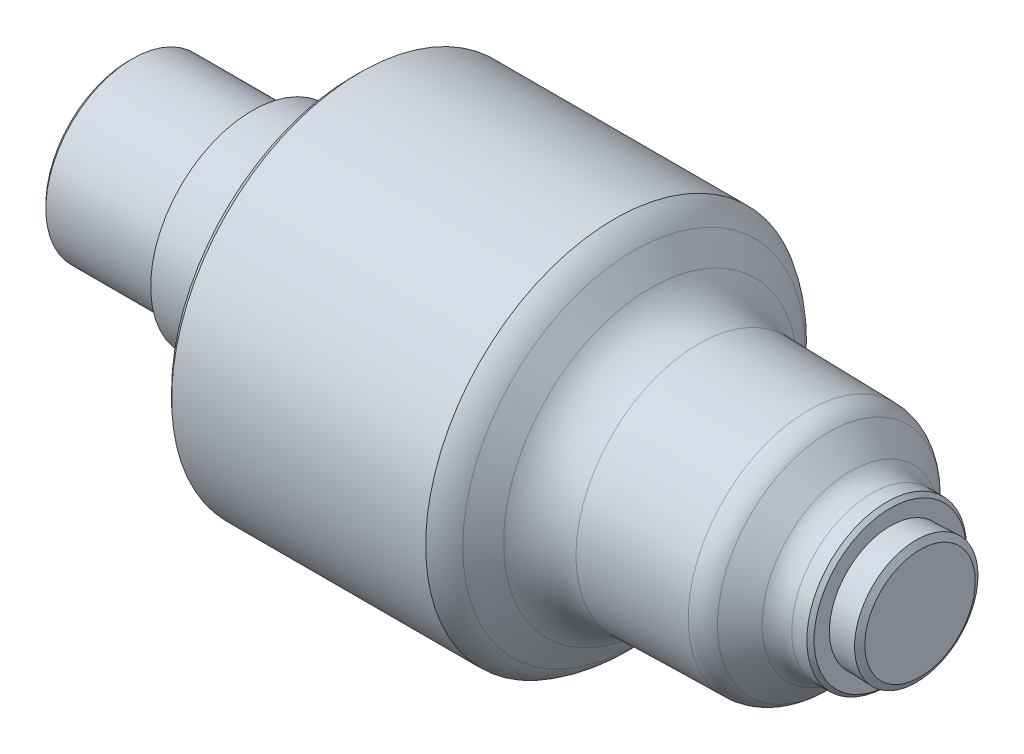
ISO-10303-21;
HEADER;
FILE_DESCRIPTION(('STEP AP214'),'2;1');
FILE_NAME('part.step','',(''),(''),'','','');
FILE_SCHEMA(('AUTOMOTIVE_DESIGN { 1 0 10303 214 1 1 1 1 }'));
ENDSEC;
DATA;
#1=APPLICATION_CONTEXT('core data for automotive mechanical design processes');
#2=APPLICATION_PROTOCOL_DEFINITION('international standard','automotive_design',2000,#1);
#3=PRODUCT_CONTEXT('',#1,'mechanical');
#4=PRODUCT('Part','Part','',(#3));
#5=PRODUCT_RELATED_PRODUCT_CATEGORY('part','',(#4));
#6=PRODUCT_DEFINITION_FORMATION('','',#4);
#7=PRODUCT_DEFINITION_CONTEXT('part definition',#1,'design');
#8=PRODUCT_DEFINITION('design','',#6,#7);
#9=PRODUCT_DEFINITION_SHAPE('','',#8);
#10=(LENGTH_UNIT() NAMED_UNIT(*) SI_UNIT(.MILLI.,.METRE.));
#11=(NAMED_UNIT(*) PLANE_ANGLE_UNIT() SI_UNIT($,.RADIAN.));
#12=(NAMED_UNIT(*) SI_UNIT($,.STERADIAN.) SOLID_ANGLE_UNIT());
#13=UNCERTAINTY_MEASURE_WITH_UNIT(LENGTH_MEASURE(1.E-05),#10,'distance_accuracy_value','');
#14=(GEOMETRIC_REPRESENTATION_CONTEXT(3) GLOBAL_UNCERTAINTY_ASSIGNED_CONTEXT((#13)) GLOBAL_UNIT_ASSIGNED_CONTEXT((#10,
#11,#12)) REPRESENTATION_CONTEXT('',''));
#15=CARTESIAN_POINT('',(0.,0.,0.));
#16=DIRECTION('',(0.,0.,1.));
#17=DIRECTION('',(1.,0.,0.));
#18=AXIS2_PLACEMENT_3D('',#15,#16,#17);
#19=CARTESIAN_POINT('',(14.4277845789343,12.4765331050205,0.));
#20=DIRECTION('',(-1.,0.,0.));
#21=DIRECTION('',(0.,0.,1.));
#22=AXIS2_PLACEMENT_3D('',#19,#20,#21);
#23=CONICAL_SURFACE('',#22,0.47545206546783,1.04719587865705);
#24=CARTESIAN_POINT('',(14.3954459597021,12.4765331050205,0.));
#25=DIRECTION('',(1.,0.,0.));
#26=DIRECTION('',(0.,0.,-1.));
#27=AXIS2_PLACEMENT_3D('',#24,#25,#26);
#28=CIRCLE('',#27,0.53146398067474);
#29=CARTESIAN_POINT('',(14.3954459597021,12.4765331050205,-0.53146398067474));
#30=VERTEX_POINT('',#29);
#31=EDGE_CURVE('E45',#30,#30,#28,.T.);
#32=ORIENTED_EDGE('',*,*,#31,.T.);
#33=EDGE_LOOP('',(#32));
#34=FACE_BOUND('',#33,.T.);
#35=CARTESIAN_POINT('',(14.4277845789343,12.4765331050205,0.));
#36=DIRECTION('',(1.,0.,0.));
#37=DIRECTION('',(0.,0.,-1.));
#38=AXIS2_PLACEMENT_3D('',#35,#36,#37);
#39=CIRCLE('',#38,0.47545206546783);
#40=CARTESIAN_POINT('',(14.4277845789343,12.4765331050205,-0.47545206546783));
#41=VERTEX_POINT('',#40);
#42=EDGE_CURVE('E111',#41,#41,#39,.T.);
#43=ORIENTED_EDGE('',*,*,#42,.F.);
#44=EDGE_LOOP('',(#43));
#45=FACE_BOUND('',#44,.T.);
#46=ADVANCED_FACE('F32',(#34,#45),#23,.T.);
#47=CARTESIAN_POINT('',(14.1717845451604,12.4765331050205,0.));
#48=DIRECTION('',(1.,0.,0.));
#49=DIRECTION('',(0.,0.,-1.));
#50=AXIS2_PLACEMENT_3D('',#47,#48,#49);
#51=CONICAL_SURFACE('',#50,0.524630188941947,0.0305446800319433);
#52=ORIENTED_EDGE('',*,*,#31,.F.);
#53=EDGE_LOOP('',(#52));
#54=FACE_BOUND('',#53,.T.);
#55=CARTESIAN_POINT('',(14.1717845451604,12.4765331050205,0.));
#56=DIRECTION('',(1.,0.,0.));
#57=DIRECTION('',(0.,0.,-1.));
#58=AXIS2_PLACEMENT_3D('',#55,#56,#57);
#59=CIRCLE('',#58,0.524630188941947);
#60=CARTESIAN_POINT('',(14.1717845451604,12.4765331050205,-0.524630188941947));
#61=VERTEX_POINT('',#60);
#62=EDGE_CURVE('E49',#61,#61,#59,.T.);
#63=ORIENTED_EDGE('',*,*,#62,.T.);
#64=EDGE_LOOP('',(#63));
#65=FACE_BOUND('',#64,.T.);
#66=ADVANCED_FACE('F123',(#54,#65),#51,.T.);
#67=CARTESIAN_POINT('',(14.1717845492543,-8.30016112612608,0.));
#68=DIRECTION('',(-1.,0.,0.));
#69=DIRECTION('',(0.,0.,1.));
#70=AXIS2_PLACEMENT_3D('',#67,#68,#69);
#71=PLANE('',#70);
#72=ORIENTED_EDGE('',*,*,#62,.F.);
#73=EDGE_LOOP('',(#72));
#74=FACE_BOUND('',#73,.T.);
#75=CARTESIAN_POINT('',(14.1717845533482,12.4765331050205,0.));
#76=DIRECTION('',(1.,0.,0.));
#77=DIRECTION('',(0.,0.,-1.));
#78=AXIS2_PLACEMENT_3D('',#75,#76,#77);
#79=CIRCLE('',#78,0.656500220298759);
#80=CARTESIAN_POINT('',(14.1717845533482,12.4765331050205,-0.656500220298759));
#81=VERTEX_POINT('',#80);
#82=EDGE_CURVE('E54',#81,#81,#79,.T.);
#83=ORIENTED_EDGE('',*,*,#82,.T.);
#84=EDGE_LOOP('',(#83));
#85=FACE_BOUND('',#84,.T.);
#86=ADVANCED_FACE('F127',(#74,#85),#71,.F.);
#87=CARTESIAN_POINT('',(14.1407866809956,12.4765331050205,0.));
#88=DIRECTION('',(-1.,0.,0.));
#89=DIRECTION('',(0.,0.,1.));
#90=AXIS2_PLACEMENT_3D('',#87,#88,#89);
#91=CONICAL_SURFACE('',#90,0.687498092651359,0.785398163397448);
#92=ORIENTED_EDGE('',*,*,#82,.F.);
#93=EDGE_LOOP('',(#92));
#94=FACE_BOUND('',#93,.T.);
#95=CARTESIAN_POINT('',(14.1407866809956,12.4765331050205,0.));
#96=DIRECTION('',(1.,0.,0.));
#97=DIRECTION('',(0.,0.,-1.));
#98=AXIS2_PLACEMENT_3D('',#95,#96,#97);
#99=CIRCLE('',#98,0.687498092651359);
#100=CARTESIAN_POINT('',(14.1407866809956,12.4765331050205,-0.687498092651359));
#101=VERTEX_POINT('',#100);
#102=EDGE_CURVE('E57',#101,#101,#99,.T.);
#103=ORIENTED_EDGE('',*,*,#102,.T.);
#104=EDGE_LOOP('',(#103));
#105=FACE_BOUND('',#104,.T.);
#106=ADVANCED_FACE('F131',(#94,#105),#91,.T.);
#107=CARTESIAN_POINT('',(14.4877113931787,12.4765331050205,0.));
#108=DIRECTION('',(1.,0.,0.));
#109=DIRECTION('',(0.,0.,-1.));
#110=AXIS2_PLACEMENT_3D('',#107,#108,#109);
#111=CYLINDRICAL_SURFACE('',#110,0.687498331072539);
#112=ORIENTED_EDGE('',*,*,#102,.F.);
#113=EDGE_LOOP('',(#112));
#114=FACE_BOUND('',#113,.T.);
#115=CARTESIAN_POINT('',(14.0113916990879,12.4765331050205,0.));
#116=DIRECTION('',(1.,0.,0.));
#117=DIRECTION('',(0.,0.,-1.));
#118=AXIS2_PLACEMENT_3D('',#115,#116,#117);
#119=CIRCLE('',#118,0.687498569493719);
#120=CARTESIAN_POINT('',(14.0113916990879,12.4765331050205,-0.687498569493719));
#121=VERTEX_POINT('',#120);
#122=EDGE_CURVE('E60',#121,#121,#119,.T.);
#123=ORIENTED_EDGE('',*,*,#122,.T.);
#124=EDGE_LOOP('',(#123));
#125=FACE_BOUND('',#124,.T.);
#126=ADVANCED_FACE('F135',(#114,#125),#111,.T.);
#127=CARTESIAN_POINT('',(14.0113926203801,12.4765331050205,0.));
#128=DIRECTION('',(1.,0.,0.));
#129=DIRECTION('',(0.,0.,-1.));
#130=AXIS2_PLACEMENT_3D('',#127,#128,#129);
#131=TOROIDAL_SURFACE('',#130,0.937498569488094,0.249999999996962);
#132=ORIENTED_EDGE('',*,*,#122,.F.);
#133=EDGE_LOOP('',(#132));
#134=FACE_BOUND('',#133,.T.);
#135=CARTESIAN_POINT('',(13.8315569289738,12.4765331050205,0.));
#136=DIRECTION('',(1.,0.,0.));
#137=DIRECTION('',(0.,0.,-1.));
#138=AXIS2_PLACEMENT_3D('',#135,#136,#137);
#139=CIRCLE('',#138,0.763834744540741);
#140=CARTESIAN_POINT('',(13.8315569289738,12.4765331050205,-0.763834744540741));
#141=VERTEX_POINT('',#140);
#142=EDGE_CURVE('E63',#141,#141,#139,.T.);
#143=ORIENTED_EDGE('',*,*,#142,.T.);
#144=EDGE_LOOP('',(#143));
#145=FACE_BOUND('',#144,.T.);
#146=ADVANCED_FACE('F139',(#134,#145),#131,.F.);
#147=CARTESIAN_POINT('',(13.6427108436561,12.4765331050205,0.));
#148=DIRECTION('',(-1.,0.,0.));
#149=DIRECTION('',(0.,0.,1.));
#150=AXIS2_PLACEMENT_3D('',#147,#148,#149);
#151=CONICAL_SURFACE('',#150,0.959392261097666,0.802855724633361);
#152=ORIENTED_EDGE('',*,*,#142,.F.);
#153=EDGE_LOOP('',(#152));
#154=FACE_BOUND('',#153,.T.);
#155=CARTESIAN_POINT('',(13.6427108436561,12.4765331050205,0.));
#156=DIRECTION('',(1.,0.,0.));
#157=DIRECTION('',(0.,0.,-1.));
#158=AXIS2_PLACEMENT_3D('',#155,#156,#157);
#159=CIRCLE('',#158,0.959392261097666);
#160=CARTESIAN_POINT('',(13.6427108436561,12.4765331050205,-0.959392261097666));
#161=VERTEX_POINT('',#160);
#162=EDGE_CURVE('E66',#161,#161,#159,.T.);
#163=ORIENTED_EDGE('',*,*,#162,.T.);
#164=EDGE_LOOP('',(#163));
#165=FACE_BOUND('',#164,.T.);
#166=ADVANCED_FACE('F143',(#154,#165),#151,.T.);
#167=CARTESIAN_POINT('',(13.4628751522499,12.4765331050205,0.));
#168=DIRECTION('',(1.,0.,0.));
#169=DIRECTION('',(0.,0.,-1.));
#170=AXIS2_PLACEMENT_3D('',#167,#168,#169);
#171=TOROIDAL_SURFACE('',#170,0.785728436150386,0.249999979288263);
#172=CARTESIAN_POINT('',(13.4677770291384,12.4765331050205,0.));
#173=DIRECTION('',(1.,0.,0.));
#174=DIRECTION('',(0.,0.,-1.));
#175=AXIS2_PLACEMENT_3D('',#172,#173,#174);
#176=CIRCLE('',#175,1.03568033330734);
#177=CARTESIAN_POINT('',(13.4677770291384,12.4765331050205,-1.03568033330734));
#178=VERTEX_POINT('',#177);
#179=EDGE_CURVE('E69',#178,#178,#176,.T.);
#180=ORIENTED_EDGE('',*,*,#179,.T.);
#181=EDGE_LOOP('',(#180));
#182=FACE_BOUND('',#181,.T.);
#183=ORIENTED_EDGE('',*,*,#162,.F.);
#184=EDGE_LOOP('',(#183));
#185=FACE_BOUND('',#184,.T.);
#186=ADVANCED_FACE('F147',(#182,#185),#171,.T.);
#187=CARTESIAN_POINT('',(12.5190360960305,12.4765331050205,0.));
#188=DIRECTION('',(-1.,0.,0.));
#189=DIRECTION('',(0.,0.,1.));
#190=AXIS2_PLACEMENT_3D('',#187,#188,#189);
#191=CONICAL_SURFACE('',#190,1.05428635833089,0.0196087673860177);
#192=ORIENTED_EDGE('',*,*,#179,.F.);
#193=EDGE_LOOP('',(#192));
#194=FACE_BOUND('',#193,.T.);
#195=CARTESIAN_POINT('',(12.5190360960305,12.4765331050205,0.));
#196=DIRECTION('',(1.,0.,0.));
#197=DIRECTION('',(0.,0.,-1.));
#198=AXIS2_PLACEMENT_3D('',#195,#196,#197);
#199=CIRCLE('',#198,1.05428635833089);
#200=CARTESIAN_POINT('',(12.5190360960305,12.4765331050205,-1.05428635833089));
#201=VERTEX_POINT('',#200);
#202=EDGE_CURVE('E72',#201,#201,#199,.T.);
#203=ORIENTED_EDGE('',*,*,#202,.T.);
#204=EDGE_LOOP('',(#203));
#205=FACE_BOUND('',#204,.T.);
#206=ADVANCED_FACE('F151',(#194,#205),#191,.T.);
#207=CARTESIAN_POINT('',(12.5190360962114,12.4765331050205,0.));
#208=DIRECTION('',(1.,0.,0.));
#209=DIRECTION('',(0.,0.,-1.));
#210=AXIS2_PLACEMENT_3D('',#207,#208,#209);
#211=TOROIDAL_SURFACE('',#210,1.55428635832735,0.499999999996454);
#212=ORIENTED_EDGE('',*,*,#202,.F.);
#213=EDGE_LOOP('',(#212));
#214=FACE_BOUND('',#213,.T.);
#215=CARTESIAN_POINT('',(12.1094606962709,12.4765331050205,0.));
#216=DIRECTION('',(1.,0.,0.));
#217=DIRECTION('',(0.,0.,-1.));
#218=AXIS2_PLACEMENT_3D('',#215,#216,#217);
#219=CIRCLE('',#218,1.26749725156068);
#220=CARTESIAN_POINT('',(12.1094606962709,12.4765331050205,-1.26749725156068));
#221=VERTEX_POINT('',#220);
#222=EDGE_CURVE('E75',#221,#221,#219,.T.);
#223=ORIENTED_EDGE('',*,*,#222,.T.);
#224=EDGE_LOOP('',(#223));
#225=FACE_BOUND('',#224,.T.);
#226=ADVANCED_FACE('F155',(#214,#225),#211,.F.);
#227=CARTESIAN_POINT('',(11.9646636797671,12.4765331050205,0.));
#228=DIRECTION('',(-1.,0.,0.));
#229=DIRECTION('',(0.,0.,1.));
#230=AXIS2_PLACEMENT_3D('',#227,#228,#229);
#231=CONICAL_SURFACE('',#230,1.47428786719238,0.959928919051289);
#232=ORIENTED_EDGE('',*,*,#222,.F.);
#233=EDGE_LOOP('',(#232));
#234=FACE_BOUND('',#233,.T.);
#235=CARTESIAN_POINT('',(11.9646636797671,12.4765331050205,0.));
#236=DIRECTION('',(1.,0.,0.));
#237=DIRECTION('',(0.,0.,-1.));
#238=AXIS2_PLACEMENT_3D('',#235,#236,#237);
#239=CIRCLE('',#238,1.47428786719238);
#240=CARTESIAN_POINT('',(11.9646636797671,12.4765331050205,-1.47428786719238));
#241=VERTEX_POINT('',#240);
#242=EDGE_CURVE('E78',#241,#241,#239,.T.);
#243=ORIENTED_EDGE('',*,*,#242,.T.);
#244=EDGE_LOOP('',(#243));
#245=FACE_BOUND('',#244,.T.);
#246=ADVANCED_FACE('F159',(#234,#245),#231,.T.);
#247=CARTESIAN_POINT('',(11.5550882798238,12.4765331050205,0.));
#248=DIRECTION('',(1.,0.,0.));
#249=DIRECTION('',(0.,0.,-1.));
#250=AXIS2_PLACEMENT_3D('',#247,#248,#249);
#251=TOROIDAL_SURFACE('',#250,1.18749876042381,0.499999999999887);
#252=CARTESIAN_POINT('',(11.7962433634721,12.4765331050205,0.));
#253=DIRECTION('',(1.,0.,0.));
#254=DIRECTION('',(0.,0.,-1.));
#255=AXIS2_PLACEMENT_3D('',#252,#253,#254);
#256=CIRCLE('',#255,1.62549901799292);
#257=CARTESIAN_POINT('',(11.7962433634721,12.4765331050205,-1.62549901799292));
#258=VERTEX_POINT('',#257);
#259=EDGE_CURVE('E81',#258,#258,#256,.T.);
#260=ORIENTED_EDGE('',*,*,#259,.T.);
#261=EDGE_LOOP('',(#260));
#262=FACE_BOUND('',#261,.T.);
#263=ORIENTED_EDGE('',*,*,#242,.F.);
#264=EDGE_LOOP('',(#263));
#265=FACE_BOUND('',#264,.T.);
#266=ADVANCED_FACE('F163',(#262,#265),#251,.T.);
#267=CARTESIAN_POINT('',(14.4877113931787,12.4765331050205,0.));
#268=DIRECTION('',(1.,0.,0.));
#269=DIRECTION('',(0.,0.,-1.));
#270=AXIS2_PLACEMENT_3D('',#267,#268,#269);
#271=CYLINDRICAL_SURFACE('',#270,1.62549925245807);
#272=ORIENTED_EDGE('',*,*,#259,.F.);
#273=EDGE_LOOP('',(#272));
#274=FACE_BOUND('',#273,.T.);
#275=CARTESIAN_POINT('',(9.6087846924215,12.4765331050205,0.));
#276=DIRECTION('',(1.,0.,0.));
#277=DIRECTION('',(0.,0.,-1.));
#278=AXIS2_PLACEMENT_3D('',#275,#276,#277);
#279=CIRCLE('',#278,1.62549948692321);
#280=CARTESIAN_POINT('',(9.6087846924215,12.4765331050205,-1.62549948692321));
#281=VERTEX_POINT('',#280);
#282=EDGE_CURVE('E84',#281,#281,#279,.T.);
#283=ORIENTED_EDGE('',*,*,#282,.T.);
#284=EDGE_LOOP('',(#283));
#285=FACE_BOUND('',#284,.T.);
#286=ADVANCED_FACE('F167',(#274,#285),#271,.T.);
#287=CARTESIAN_POINT('',(9.6087846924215,12.4765331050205,0.));
#288=DIRECTION('',(1.,0.,0.));
#289=DIRECTION('',(0.,0.,-1.));
#290=AXIS2_PLACEMENT_3D('',#287,#288,#289);
#291=CONICAL_SURFACE('',#290,1.62549948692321,0.785398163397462);
#292=CARTESIAN_POINT('',(9.54678489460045,12.4765331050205,0.));
#293=DIRECTION('',(1.,0.,0.));
#294=DIRECTION('',(0.,0.,-1.));
#295=AXIS2_PLACEMENT_3D('',#292,#293,#294);
#296=CIRCLE('',#295,1.56349968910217);
#297=CARTESIAN_POINT('',(9.54678489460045,12.4765331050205,-1.56349968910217));
#298=VERTEX_POINT('',#297);
#299=EDGE_CURVE('E87',#298,#298,#296,.T.);
#300=ORIENTED_EDGE('',*,*,#299,.T.);
#301=EDGE_LOOP('',(#300));
#302=FACE_BOUND('',#301,.T.);
#303=ORIENTED_EDGE('',*,*,#282,.F.);
#304=EDGE_LOOP('',(#303));
#305=FACE_BOUND('',#304,.T.);
#306=ADVANCED_FACE('F171',(#302,#305),#291,.T.);
#307=CARTESIAN_POINT('',(9.5467848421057,-8.300160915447,0.));
#308=DIRECTION('',(1.,0.,0.));
#309=DIRECTION('',(0.,0.,-1.));
#310=AXIS2_PLACEMENT_3D('',#307,#308,#309);
#311=PLANE('',#310);
#312=ORIENTED_EDGE('',*,*,#299,.F.);
#313=EDGE_LOOP('',(#312));
#314=FACE_BOUND('',#313,.T.);
#315=CARTESIAN_POINT('',(9.54678478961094,12.4765331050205,0.));
#316=DIRECTION('',(1.,0.,0.));
#317=DIRECTION('',(0.,0.,-1.));
#318=AXIS2_PLACEMENT_3D('',#315,#316,#317);
#319=CIRCLE('',#318,0.875000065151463);
#320=CARTESIAN_POINT('',(9.54678478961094,12.4765331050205,-0.875000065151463));
#321=VERTEX_POINT('',#320);
#322=EDGE_CURVE('E90',#321,#321,#319,.T.);
#323=ORIENTED_EDGE('',*,*,#322,.T.);
#324=EDGE_LOOP('',(#323));
#325=FACE_BOUND('',#324,.T.);
#326=ADVANCED_FACE('F175',(#314,#325),#311,.F.);
#327=CARTESIAN_POINT('',(14.4877113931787,12.4765331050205,0.));
#328=DIRECTION('',(1.,0.,0.));
#329=DIRECTION('',(0.,0.,-1.));
#330=AXIS2_PLACEMENT_3D('',#327,#328,#329);
#331=CYLINDRICAL_SURFACE('',#330,0.875000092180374);
#332=ORIENTED_EDGE('',*,*,#322,.F.);
#333=EDGE_LOOP('',(#332));
#334=FACE_BOUND('',#333,.T.);
#335=CARTESIAN_POINT('',(8.67828430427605,12.4765331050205,0.));
#336=DIRECTION('',(1.,0.,0.));
#337=DIRECTION('',(0.,0.,-1.));
#338=AXIS2_PLACEMENT_3D('',#335,#336,#337);
#339=CIRCLE('',#338,0.875000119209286);
#340=CARTESIAN_POINT('',(8.67828430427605,12.4765331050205,-0.875000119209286));
#341=VERTEX_POINT('',#340);
#342=EDGE_CURVE('E93',#341,#341,#339,.T.);
#343=ORIENTED_EDGE('',*,*,#342,.T.);
#344=EDGE_LOOP('',(#343));
#345=FACE_BOUND('',#344,.T.);
#346=ADVANCED_FACE('F179',(#334,#345),#331,.T.);
#347=CARTESIAN_POINT('',(8.67828430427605,-8.30016112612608,0.));
#348=DIRECTION('',(-1.,0.,0.));
#349=DIRECTION('',(0.,0.,1.));
#350=AXIS2_PLACEMENT_3D('',#347,#348,#349);
#351=PLANE('',#350);
#352=CARTESIAN_POINT('',(8.67828430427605,12.4765331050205,0.));
#353=DIRECTION('',(1.,0.,0.));
#354=DIRECTION('',(0.,0.,-1.));
#355=AXIS2_PLACEMENT_3D('',#352,#353,#354);
#356=CIRCLE('',#355,0.687500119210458);
#357=CARTESIAN_POINT('',(8.67828430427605,12.4765331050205,-0.687500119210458));
#358=VERTEX_POINT('',#357);
#359=EDGE_CURVE('E96',#358,#358,#356,.T.);
#360=ORIENTED_EDGE('',*,*,#359,.T.);
#361=EDGE_LOOP('',(#360));
#362=FACE_BOUND('',#361,.T.);
#363=ORIENTED_EDGE('',*,*,#342,.F.);
#364=EDGE_LOOP('',(#363));
#365=FACE_BOUND('',#364,.T.);
#366=ADVANCED_FACE('F183',(#362,#365),#351,.T.);
#367=CARTESIAN_POINT('',(8.67828430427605,12.4765331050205,0.));
#368=DIRECTION('',(1.,0.,0.));
#369=DIRECTION('',(0.,0.,-1.));
#370=AXIS2_PLACEMENT_3D('',#367,#368,#369);
#371=TOROIDAL_SURFACE('',#370,0.750000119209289,0.062499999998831);
#372=ORIENTED_EDGE('',*,*,#359,.F.);
#373=EDGE_LOOP('',(#372));
#374=FACE_BOUND('',#373,.T.);
#375=CARTESIAN_POINT('',(8.63409044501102,12.4765331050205,0.));
#376=DIRECTION('',(1.,0.,0.));
#377=DIRECTION('',(0.,0.,-1.));
#378=AXIS2_PLACEMENT_3D('',#375,#376,#377);
#379=CIRCLE('',#378,0.705805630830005);
#380=CARTESIAN_POINT('',(8.63409044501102,12.4765331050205,-0.705805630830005));
#381=VERTEX_POINT('',#380);
#382=EDGE_CURVE('E99',#381,#381,#379,.T.);
#383=ORIENTED_EDGE('',*,*,#382,.T.);
#384=EDGE_LOOP('',(#383));
#385=FACE_BOUND('',#384,.T.);
#386=ADVANCED_FACE('F187',(#374,#385),#371,.F.);
#387=CARTESIAN_POINT('',(8.63409044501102,12.4765331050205,0.));
#388=DIRECTION('',(-1.,0.,0.));
#389=DIRECTION('',(0.,0.,1.));
#390=AXIS2_PLACEMENT_3D('',#387,#388,#389);
#391=CONICAL_SURFACE('',#390,0.705805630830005,0.785391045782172);
#392=CARTESIAN_POINT('',(8.59389509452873,12.4765331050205,0.));
#393=DIRECTION('',(1.,0.,0.));
#394=DIRECTION('',(0.,0.,-1.));
#395=AXIS2_PLACEMENT_3D('',#392,#393,#394);
#396=CIRCLE('',#395,0.746000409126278);
#397=CARTESIAN_POINT('',(8.59389509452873,12.4765331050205,-0.746000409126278));
#398=VERTEX_POINT('',#397);
#399=EDGE_CURVE('E102',#398,#398,#396,.T.);
#400=ORIENTED_EDGE('',*,*,#399,.T.);
#401=EDGE_LOOP('',(#400));
#402=FACE_BOUND('',#401,.T.);
#403=ORIENTED_EDGE('',*,*,#382,.F.);
#404=EDGE_LOOP('',(#403));
#405=FACE_BOUND('',#404,.T.);
#406=ADVANCED_FACE('F191',(#402,#405),#391,.T.);
#407=CARTESIAN_POINT('',(14.4877113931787,12.4765331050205,0.));
#408=DIRECTION('',(1.,0.,0.));
#409=DIRECTION('',(0.,0.,-1.));
#410=AXIS2_PLACEMENT_3D('',#407,#408,#409);
#411=CYLINDRICAL_SURFACE('',#410,0.746000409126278);
#412=ORIENTED_EDGE('',*,*,#399,.F.);
#413=EDGE_LOOP('',(#412));
#414=FACE_BOUND('',#413,.T.);
#415=CARTESIAN_POINT('',(7.64678301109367,12.4765331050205,0.));
#416=DIRECTION('',(1.,0.,0.));
#417=DIRECTION('',(0.,0.,-1.));
#418=AXIS2_PLACEMENT_3D('',#415,#416,#417);
#419=CIRCLE('',#418,0.746000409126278);
#420=CARTESIAN_POINT('',(7.64678301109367,12.4765331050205,-0.746000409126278));
#421=VERTEX_POINT('',#420);
#422=EDGE_CURVE('E105',#421,#421,#419,.T.);
#423=ORIENTED_EDGE('',*,*,#422,.T.);
#424=EDGE_LOOP('',(#423));
#425=FACE_BOUND('',#424,.T.);
#426=ADVANCED_FACE('F195',(#414,#425),#411,.T.);
#427=CARTESIAN_POINT('',(7.64678301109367,12.4765331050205,0.));
#428=DIRECTION('',(1.,0.,0.));
#429=DIRECTION('',(0.,0.,-1.));
#430=AXIS2_PLACEMENT_3D('',#427,#428,#429);
#431=CONICAL_SURFACE('',#430,0.746000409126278,0.785413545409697);
#432=CARTESIAN_POINT('',(7.61578382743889,12.4765331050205,0.));
#433=DIRECTION('',(1.,0.,0.));
#434=DIRECTION('',(0.,0.,-1.));
#435=AXIS2_PLACEMENT_3D('',#432,#433,#434);
#436=CIRCLE('',#435,0.715000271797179);
#437=CARTESIAN_POINT('',(7.61578382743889,12.4765331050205,-0.715000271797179));
#438=VERTEX_POINT('',#437);
#439=EDGE_CURVE('E108',#438,#438,#436,.T.);
#440=ORIENTED_EDGE('',*,*,#439,.T.);
#441=EDGE_LOOP('',(#440));
#442=FACE_BOUND('',#441,.T.);
#443=ORIENTED_EDGE('',*,*,#422,.F.);
#444=EDGE_LOOP('',(#443));
#445=FACE_BOUND('',#444,.T.);
#446=ADVANCED_FACE('F199',(#442,#445),#431,.T.);
#447=CARTESIAN_POINT('',(7.61578382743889,-8.30016112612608,0.));
#448=DIRECTION('',(-1.,0.,0.));
#449=DIRECTION('',(0.,0.,1.));
#450=AXIS2_PLACEMENT_3D('',#447,#448,#449);
#451=PLANE('',#450);
#452=ORIENTED_EDGE('',*,*,#439,.F.);
#453=EDGE_LOOP('',(#452));
#454=FACE_BOUND('',#453,.T.);
#455=ADVANCED_FACE('F203',(#454),#451,.T.);
#456=CARTESIAN_POINT('',(14.4277845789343,-8.30016112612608,0.));
#457=DIRECTION('',(-1.,0.,0.));
#458=DIRECTION('',(0.,0.,1.));
#459=AXIS2_PLACEMENT_3D('',#456,#457,#458);
#460=PLANE('',#459);
#461=ORIENTED_EDGE('',*,*,#42,.T.);
#462=EDGE_LOOP('',(#461));
#463=FACE_BOUND('',#462,.T.);
#464=ADVANCED_FACE('F207',(#463),#460,.F.);
#465=CLOSED_SHELL('',(#46,#66,#86,#106,#126,#146,#166,#186,#206,#226,#246,#266,#286,#306,#326,
#346,#366,#386,#406,#426,#446,#455,#464));
#466=CARTESIAN_POINT('',(11.3897844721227,13.8838227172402,0.));
#467=DIRECTION('',(0.,0.,1.));
#468=DIRECTION('',(-1.,0.,0.));
#469=AXIS2_PLACEMENT_3D('',#466,#467,#468);
#470=ELLIPSE('',#469,0.169500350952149,0.0922903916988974);
#471=CARTESIAN_POINT('',(14.4877113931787,12.4765331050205,0.));
#472=DIRECTION('',(1.,0.,0.));
#473=AXIS1_PLACEMENT('',#471,#472);
#474=SURFACE_OF_REVOLUTION('',#470,#473);
#475=CARTESIAN_POINT('',(11.465334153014,12.4765331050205,0.));
#476=DIRECTION('',(1.,0.,0.));
#477=DIRECTION('',(0.,0.,-1.));
#478=AXIS2_PLACEMENT_3D('',#475,#476,#477);
#479=CIRCLE('',#478,1.32467379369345);
#480=CARTESIAN_POINT('',(11.465334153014,12.4765331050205,-1.32467379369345));
#481=VERTEX_POINT('',#480);
#482=EDGE_CURVE('E41',#481,#481,#479,.T.);
#483=ORIENTED_EDGE('',*,*,#482,.F.);
#484=EDGE_LOOP('',(#483));
#485=FACE_BOUND('',#484,.T.);
#486=CARTESIAN_POINT('',(11.3142347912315,12.4765331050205,0.));
#487=DIRECTION('',(1.,0.,0.));
#488=DIRECTION('',(0.,0.,-1.));
#489=AXIS2_PLACEMENT_3D('',#486,#487,#488);
#490=CIRCLE('',#489,1.32467379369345);
#491=CARTESIAN_POINT('',(11.3142347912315,12.4765331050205,-1.32467379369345));
#492=VERTEX_POINT('',#491);
#493=EDGE_CURVE('E10',#492,#492,#490,.T.);
#494=ORIENTED_EDGE('',*,*,#493,.T.);
#495=EDGE_LOOP('',(#494));
#496=FACE_BOUND('',#495,.T.);
#497=ADVANCED_FACE('F34',(#485,#496),#474,.T.);
#498=CARTESIAN_POINT('',(11.3897844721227,13.7322974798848,0.));
#499=DIRECTION('',(0.,0.,1.));
#500=DIRECTION('',(-1.,0.,0.));
#501=AXIS2_PLACEMENT_3D('',#498,#499,#500);
#502=ELLIPSE('',#501,0.169500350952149,0.0769789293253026);
#503=CARTESIAN_POINT('',(14.4877113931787,12.4765331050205,0.));
#504=DIRECTION('',(1.,0.,0.));
#505=AXIS1_PLACEMENT('',#503,#504);
#506=SURFACE_OF_REVOLUTION('',#502,#505);
#507=ORIENTED_EDGE('',*,*,#493,.F.);
#508=EDGE_LOOP('',(#507));
#509=FACE_BOUND('',#508,.T.);
#510=ORIENTED_EDGE('',*,*,#482,.T.);
#511=EDGE_LOOP('',(#510));
#512=FACE_BOUND('',#511,.T.);
#513=ADVANCED_FACE('F116',(#509,#512),#506,.T.);
#514=CLOSED_SHELL('',(#497,#513));
#515=ORIENTED_CLOSED_SHELL('',*,#514,.T.);
#516=BREP_WITH_VOIDS('B2',#465,(#515));
#517=ADVANCED_BREP_SHAPE_REPRESENTATION('',(#18,#516),#14);
#518=SHAPE_DEFINITION_REPRESENTATION(#9,#517);
ENDSEC;
END-ISO-10303-21;
